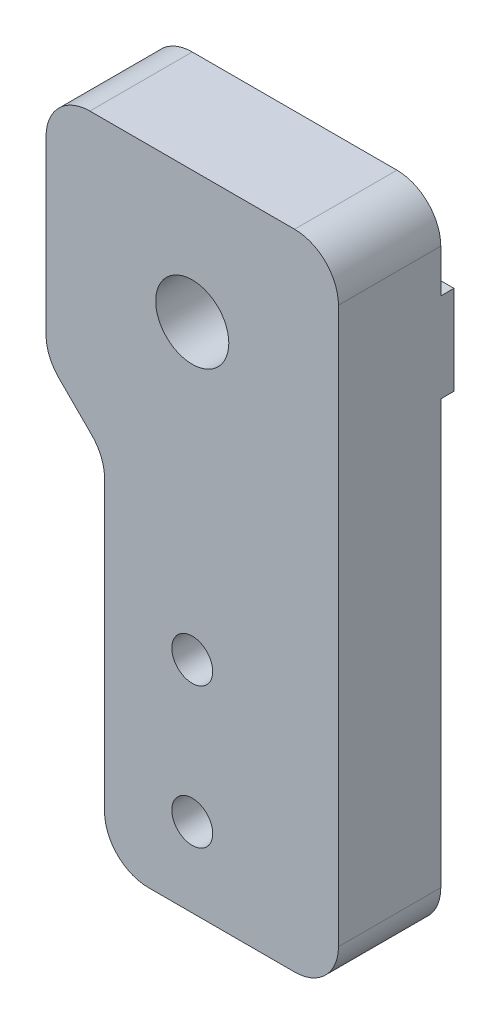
from build123d import *

# Parameters (mm, degrees)
SKETCH1_R           = 2.5
SKETCH1_R_2         = 1.4
BOSS_EXTRUDE1_DEPTH = 7
SKETCH2_W           = 0.9
SKETCH2_H           = 6.1
BOSS_EXTRUDE2_DEPTH = 20
CUT_EXTRUDE1_REACH  = 50.836
SKETCH3_R           = 2.5
CUT_EXTRUDE2_START  = -7
CUT_EXTRUDE2_DEPTH  = 7
FILLET1_R           = 3


with BuildPart() as part:
    # Sketch1 → Boss-Extrude1 (new body)
    with BuildSketch(Plane.XY):
        with BuildLine():
            Line((3, 0), (17, 0))
            ThreePointArc((17, 0), (19.121320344, 0.878679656), (20, 3))
            Line((20, 3), (20, 41))
            ThreePointArc((20, 41), (19.121320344, 43.121320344), (17, 44))
            Line((17, 44), (3, 44))
            ThreePointArc((3, 44), (0.878679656, 43.121320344), (0, 41))
            Line((0, 41), (0, 3))
            ThreePointArc((0, 3), (0.878679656, 0.878679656), (3, 0))
        make_face()
        with Locations((10, 35)):
            Circle(SKETCH1_R, mode=Mode.SUBTRACT)
        with Locations((10, 5.4)):
            Circle(SKETCH1_R_2, mode=Mode.SUBTRACT)
        with Locations((10, 15)):
            Circle(SKETCH1_R_2, mode=Mode.SUBTRACT)
    extrude(amount=BOSS_EXTRUDE1_DEPTH)

    # Sketch2 → Boss-Extrude2 (add)
    with BuildSketch(Plane(origin=(20, 0, 0), x_dir=(0, 0, -1), z_dir=(1, 0, 0))):
        with Locations((0.45, 35)):
            Rectangle(SKETCH2_W, SKETCH2_H)
    extrude(amount=-BOSS_EXTRUDE2_DEPTH)

    # Sketch3 → Cut-Extrude1 (cut, up to next)
    with BuildSketch(Plane.XY, mode=Mode.PRIVATE) as cut_extrude1_sk1:
        with Locations((10, 35)):
            Circle(SKETCH3_R)
    cut_extrude1_tool1 = extrude(cut_extrude1_sk1.sketch, amount=-CUT_EXTRUDE1_REACH, mode=Mode.PRIVATE) & part.part
    add(cut_extrude1_tool1.solids().sort_by_distance((10, 35, 0))[0], mode=Mode.SUBTRACT)

    # Sketch4 → Cut-Extrude2 (cut)
    with BuildSketch(Plane.XY.offset(7).offset(CUT_EXTRUDE2_START)):
        with BuildLine():
            Line((0, 28), (4, 24))
            Line((4, 24), (4, 0))
            Line((4, 0), (3, 0))
            ThreePointArc((3, 0), (0.878679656, 0.878679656), (0, 3))
            Line((0, 3), (0, 28))
        make_face()
    extrude(amount=CUT_EXTRUDE2_DEPTH, mode=Mode.SUBTRACT)

    # Fillet1
    fillet1_edges = [part.edges().sort_by_distance(p)[0] for p in [
        (0, 28, 3.5),
        (4, 24, 3.5),
        (4, 0, 3.5),
    ]]
    fillet(fillet1_edges, radius=FILLET1_R)


solid = part.part
